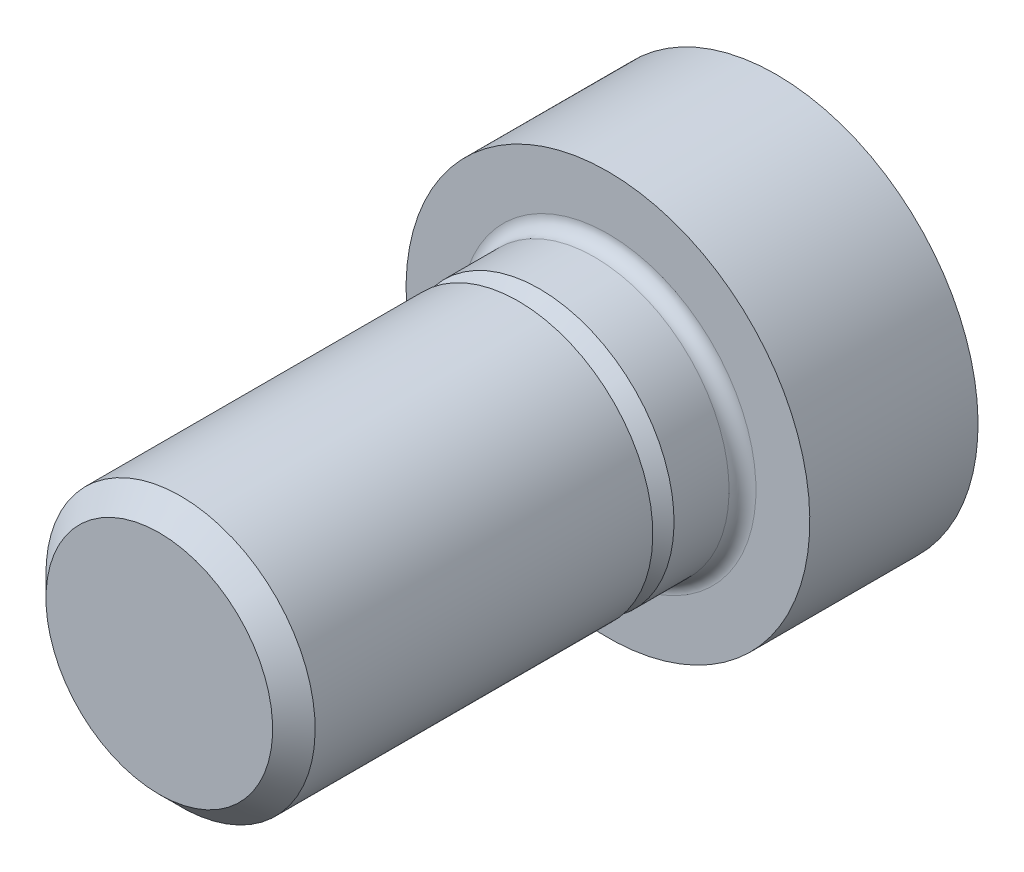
ISO-10303-21;
HEADER;
FILE_DESCRIPTION(('STEP AP214'),'2;1');
FILE_NAME('part.step','',(''),(''),'','','');
FILE_SCHEMA(('AUTOMOTIVE_DESIGN { 1 0 10303 214 1 1 1 1 }'));
ENDSEC;
DATA;
#1=APPLICATION_CONTEXT('core data for automotive mechanical design processes');
#2=APPLICATION_PROTOCOL_DEFINITION('international standard','automotive_design',2000,#1);
#3=PRODUCT_CONTEXT('',#1,'mechanical');
#4=PRODUCT('Part','Part','',(#3));
#5=PRODUCT_RELATED_PRODUCT_CATEGORY('part','',(#4));
#6=PRODUCT_DEFINITION_FORMATION('','',#4);
#7=PRODUCT_DEFINITION_CONTEXT('part definition',#1,'design');
#8=PRODUCT_DEFINITION('design','',#6,#7);
#9=PRODUCT_DEFINITION_SHAPE('','',#8);
#10=(LENGTH_UNIT() NAMED_UNIT(*) SI_UNIT(.MILLI.,.METRE.));
#11=(NAMED_UNIT(*) PLANE_ANGLE_UNIT() SI_UNIT($,.RADIAN.));
#12=(NAMED_UNIT(*) SI_UNIT($,.STERADIAN.) SOLID_ANGLE_UNIT());
#13=UNCERTAINTY_MEASURE_WITH_UNIT(LENGTH_MEASURE(1.E-05),#10,'distance_accuracy_value','');
#14=(GEOMETRIC_REPRESENTATION_CONTEXT(3) GLOBAL_UNCERTAINTY_ASSIGNED_CONTEXT((#13)) GLOBAL_UNIT_ASSIGNED_CONTEXT((#10,
#11,#12)) REPRESENTATION_CONTEXT('',''));
#15=CARTESIAN_POINT('',(0.,0.,0.));
#16=DIRECTION('',(0.,0.,1.));
#17=DIRECTION('',(1.,0.,0.));
#18=AXIS2_PLACEMENT_3D('',#15,#16,#17);
#19=CARTESIAN_POINT('',(0.,2.52640625,27.5));
#20=DIRECTION('',(0.,0.,1.));
#21=DIRECTION('',(0.,1.,0.));
#22=AXIS2_PLACEMENT_3D('',#19,#20,#21);
#23=PLANE('',#22);
#24=CARTESIAN_POINT('',(0.,0.,27.5));
#25=DIRECTION('',(0.,0.,1.));
#26=DIRECTION('',(0.,1.,0.));
#27=AXIS2_PLACEMENT_3D('',#24,#25,#26);
#28=CIRCLE('',#27,5.0528125);
#29=CARTESIAN_POINT('',(0.,5.0528125,27.5));
#30=VERTEX_POINT('',#29);
#31=EDGE_CURVE('E11',#30,#30,#28,.T.);
#32=ORIENTED_EDGE('',*,*,#31,.T.);
#33=EDGE_LOOP('',(#32));
#34=FACE_BOUND('',#33,.T.);
#35=ADVANCED_FACE('F16',(#34),#23,.T.);
#36=CARTESIAN_POINT('',(0.,0.,27.02640625));
#37=DIRECTION('',(0.,0.,-1.));
#38=DIRECTION('',(0.,1.,0.));
#39=AXIS2_PLACEMENT_3D('',#36,#37,#38);
#40=CONICAL_SURFACE('',#39,5.52640625,0.785398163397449);
#41=CARTESIAN_POINT('',(0.,0.,26.5528125));
#42=DIRECTION('',(0.,0.,1.));
#43=DIRECTION('',(0.,1.,0.));
#44=AXIS2_PLACEMENT_3D('',#41,#42,#43);
#45=CIRCLE('',#44,6.);
#46=CARTESIAN_POINT('',(0.,6.,26.5528125));
#47=VERTEX_POINT('',#46);
#48=EDGE_CURVE('E26',#47,#47,#45,.T.);
#49=ORIENTED_EDGE('',*,*,#48,.T.);
#50=EDGE_LOOP('',(#49));
#51=FACE_BOUND('',#50,.T.);
#52=ORIENTED_EDGE('',*,*,#31,.F.);
#53=EDGE_LOOP('',(#52));
#54=FACE_BOUND('',#53,.T.);
#55=ADVANCED_FACE('F331',(#51,#54),#40,.T.);
#56=CARTESIAN_POINT('',(0.,0.,19.02640625));
#57=DIRECTION('',(0.,0.,-1.));
#58=DIRECTION('',(0.,1.,0.));
#59=AXIS2_PLACEMENT_3D('',#56,#57,#58);
#60=CYLINDRICAL_SURFACE('',#59,6.);
#61=CARTESIAN_POINT('',(0.,0.,11.5));
#62=DIRECTION('',(0.,0.,1.));
#63=DIRECTION('',(0.,1.,0.));
#64=AXIS2_PLACEMENT_3D('',#61,#62,#63);
#65=CIRCLE('',#64,6.);
#66=CARTESIAN_POINT('',(0.,6.,11.5));
#67=VERTEX_POINT('',#66);
#68=EDGE_CURVE('E167',#67,#67,#65,.T.);
#69=ORIENTED_EDGE('',*,*,#68,.T.);
#70=EDGE_LOOP('',(#69));
#71=FACE_BOUND('',#70,.T.);
#72=ORIENTED_EDGE('',*,*,#48,.F.);
#73=EDGE_LOOP('',(#72));
#74=FACE_BOUND('',#73,.T.);
#75=ADVANCED_FACE('F336',(#71,#74),#60,.T.);
#76=CARTESIAN_POINT('',(0.,5.52640625,11.5));
#77=DIRECTION('',(0.,0.,-1.));
#78=DIRECTION('',(0.,-1.,0.));
#79=AXIS2_PLACEMENT_3D('',#76,#77,#78);
#80=PLANE('',#79);
#81=CARTESIAN_POINT('',(0.,0.,11.5));
#82=DIRECTION('',(0.,0.,1.));
#83=DIRECTION('',(0.,1.,0.));
#84=AXIS2_PLACEMENT_3D('',#81,#82,#83);
#85=CIRCLE('',#84,5.0528125);
#86=CARTESIAN_POINT('',(0.,5.0528125,11.5));
#87=VERTEX_POINT('',#86);
#88=EDGE_CURVE('E165',#87,#87,#85,.T.);
#89=ORIENTED_EDGE('',*,*,#88,.T.);
#90=EDGE_LOOP('',(#89));
#91=FACE_BOUND('',#90,.T.);
#92=ORIENTED_EDGE('',*,*,#68,.F.);
#93=EDGE_LOOP('',(#92));
#94=FACE_BOUND('',#93,.T.);
#95=ADVANCED_FACE('F368',(#91,#94),#80,.T.);
#96=CARTESIAN_POINT('',(0.,0.,11.02640625));
#97=DIRECTION('',(0.,0.,-1.));
#98=DIRECTION('',(0.,1.,0.));
#99=AXIS2_PLACEMENT_3D('',#96,#97,#98);
#100=CONICAL_SURFACE('',#99,5.52640625,0.785398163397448);
#101=CARTESIAN_POINT('',(0.,0.,10.5528125));
#102=DIRECTION('',(0.,0.,1.));
#103=DIRECTION('',(0.,1.,0.));
#104=AXIS2_PLACEMENT_3D('',#101,#102,#103);
#105=CIRCLE('',#104,6.);
#106=CARTESIAN_POINT('',(0.,6.,10.5528125));
#107=VERTEX_POINT('',#106);
#108=EDGE_CURVE('E163',#107,#107,#105,.T.);
#109=ORIENTED_EDGE('',*,*,#108,.T.);
#110=EDGE_LOOP('',(#109));
#111=FACE_BOUND('',#110,.T.);
#112=ORIENTED_EDGE('',*,*,#88,.F.);
#113=EDGE_LOOP('',(#112));
#114=FACE_BOUND('',#113,.T.);
#115=ADVANCED_FACE('F345',(#111,#114),#100,.T.);
#116=CARTESIAN_POINT('',(0.,0.,9.32640625));
#117=DIRECTION('',(0.,0.,-1.));
#118=DIRECTION('',(0.,1.,0.));
#119=AXIS2_PLACEMENT_3D('',#116,#117,#118);
#120=CYLINDRICAL_SURFACE('',#119,6.);
#121=CARTESIAN_POINT('',(0.,0.,8.1));
#122=DIRECTION('',(0.,0.,1.));
#123=DIRECTION('',(0.,1.,0.));
#124=AXIS2_PLACEMENT_3D('',#121,#122,#123);
#125=CIRCLE('',#124,6.);
#126=CARTESIAN_POINT('',(0.,6.,8.1));
#127=VERTEX_POINT('',#126);
#128=EDGE_CURVE('E158',#127,#127,#125,.T.);
#129=ORIENTED_EDGE('',*,*,#128,.T.);
#130=EDGE_LOOP('',(#129));
#131=FACE_BOUND('',#130,.T.);
#132=ORIENTED_EDGE('',*,*,#108,.F.);
#133=EDGE_LOOP('',(#132));
#134=FACE_BOUND('',#133,.T.);
#135=ADVANCED_FACE('F341',(#131,#134),#120,.T.);
#136=CARTESIAN_POINT('',(0.,0.,8.1));
#137=DIRECTION('',(0.,0.,1.));
#138=DIRECTION('',(1.,0.,0.));
#139=AXIS2_PLACEMENT_3D('',#136,#137,#138);
#140=TOROIDAL_SURFACE('',#139,6.6,0.6);
#141=CARTESIAN_POINT('',(0.,0.,7.5));
#142=DIRECTION('',(0.,0.,1.));
#143=DIRECTION('',(0.,1.,0.));
#144=AXIS2_PLACEMENT_3D('',#141,#142,#143);
#145=CIRCLE('',#144,6.6);
#146=CARTESIAN_POINT('',(0.,6.6,7.5));
#147=VERTEX_POINT('',#146);
#148=EDGE_CURVE('E164',#147,#147,#145,.T.);
#149=ORIENTED_EDGE('',*,*,#148,.T.);
#150=EDGE_LOOP('',(#149));
#151=FACE_BOUND('',#150,.T.);
#152=ORIENTED_EDGE('',*,*,#128,.F.);
#153=EDGE_LOOP('',(#152));
#154=FACE_BOUND('',#153,.T.);
#155=ADVANCED_FACE('F344',(#151,#154),#140,.F.);
#156=CARTESIAN_POINT('',(0.,7.8,7.5));
#157=DIRECTION('',(0.,0.,1.));
#158=DIRECTION('',(0.,1.,0.));
#159=AXIS2_PLACEMENT_3D('',#156,#157,#158);
#160=PLANE('',#159);
#161=CARTESIAN_POINT('',(0.,0.,7.5));
#162=DIRECTION('',(0.,0.,1.));
#163=DIRECTION('',(0.,1.,0.));
#164=AXIS2_PLACEMENT_3D('',#161,#162,#163);
#165=CIRCLE('',#164,9.);
#166=CARTESIAN_POINT('',(0.,9.,7.5));
#167=VERTEX_POINT('',#166);
#168=EDGE_CURVE('E204',#167,#167,#165,.T.);
#169=ORIENTED_EDGE('',*,*,#168,.T.);
#170=EDGE_LOOP('',(#169));
#171=FACE_BOUND('',#170,.T.);
#172=ORIENTED_EDGE('',*,*,#148,.F.);
#173=EDGE_LOOP('',(#172));
#174=FACE_BOUND('',#173,.T.);
#175=ADVANCED_FACE('F461',(#171,#174),#160,.T.);
#176=CARTESIAN_POINT('',(0.,0.,3.75));
#177=DIRECTION('',(0.,0.,-1.));
#178=DIRECTION('',(0.,1.,0.));
#179=AXIS2_PLACEMENT_3D('',#176,#177,#178);
#180=CYLINDRICAL_SURFACE('',#179,9.);
#181=CARTESIAN_POINT('',(0.,0.,0.));
#182=DIRECTION('',(0.,0.,1.));
#183=DIRECTION('',(0.,1.,0.));
#184=AXIS2_PLACEMENT_3D('',#181,#182,#183);
#185=CIRCLE('',#184,9.);
#186=CARTESIAN_POINT('',(0.,9.,0.));
#187=VERTEX_POINT('',#186);
#188=EDGE_CURVE('E202',#187,#187,#185,.T.);
#189=ORIENTED_EDGE('',*,*,#188,.T.);
#190=EDGE_LOOP('',(#189));
#191=FACE_BOUND('',#190,.T.);
#192=ORIENTED_EDGE('',*,*,#168,.F.);
#193=EDGE_LOOP('',(#192));
#194=FACE_BOUND('',#193,.T.);
#195=ADVANCED_FACE('F452',(#191,#194),#180,.T.);
#196=CARTESIAN_POINT('',(0.,4.5,0.));
#197=DIRECTION('',(0.,0.,-1.));
#198=DIRECTION('',(0.,-1.,0.));
#199=AXIS2_PLACEMENT_3D('',#196,#197,#198);
#200=PLANE('',#199);
#201=ORIENTED_EDGE('',*,*,#188,.F.);
#202=EDGE_LOOP('',(#201));
#203=FACE_BOUND('',#202,.T.);
#204=DIRECTION('',(0.866025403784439,-0.5,0.));
#205=VECTOR('',#204,1.);
#206=CARTESIAN_POINT('',(-3.47427857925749,-3.76762701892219,0.));
#207=LINE('',#206,#205);
#208=CARTESIAN_POINT('',(-5.,-2.88675134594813,0.));
#209=VERTEX_POINT('',#208);
#210=CARTESIAN_POINT('',(0.,-5.77350269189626,0.));
#211=VERTEX_POINT('',#210);
#212=EDGE_CURVE('E117',#209,#211,#207,.T.);
#213=ORIENTED_EDGE('',*,*,#212,.T.);
#214=DIRECTION('',(0.866025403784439,0.5,0.));
#215=VECTOR('',#214,1.);
#216=CARTESIAN_POINT('',(3.47427857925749,-3.76762701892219,0.));
#217=LINE('',#216,#215);
#218=CARTESIAN_POINT('',(5.,-2.88675134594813,0.));
#219=VERTEX_POINT('',#218);
#220=EDGE_CURVE('E256',#211,#219,#217,.T.);
#221=ORIENTED_EDGE('',*,*,#220,.T.);
#222=DIRECTION('',(0.,1.,0.));
#223=VECTOR('',#222,1.);
#224=CARTESIAN_POINT('',(5.,2.25,0.));
#225=LINE('',#224,#223);
#226=CARTESIAN_POINT('',(5.,2.88675134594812,0.));
#227=VERTEX_POINT('',#226);
#228=EDGE_CURVE('E245',#219,#227,#225,.T.);
#229=ORIENTED_EDGE('',*,*,#228,.T.);
#230=DIRECTION('',(-0.866025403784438,0.5,0.));
#231=VECTOR('',#230,1.);
#232=CARTESIAN_POINT('',(1.5257214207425,4.89262701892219,0.));
#233=LINE('',#232,#231);
#234=CARTESIAN_POINT('',(0.,5.77350269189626,0.));
#235=VERTEX_POINT('',#234);
#236=EDGE_CURVE('E181',#227,#235,#233,.T.);
#237=ORIENTED_EDGE('',*,*,#236,.T.);
#238=DIRECTION('',(-0.866025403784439,-0.5,0.));
#239=VECTOR('',#238,1.);
#240=CARTESIAN_POINT('',(-1.5257214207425,4.89262701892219,0.));
#241=LINE('',#240,#239);
#242=CARTESIAN_POINT('',(-5.,2.88675134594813,0.));
#243=VERTEX_POINT('',#242);
#244=EDGE_CURVE('E141',#235,#243,#241,.T.);
#245=ORIENTED_EDGE('',*,*,#244,.T.);
#246=DIRECTION('',(0.,-1.,0.));
#247=VECTOR('',#246,1.);
#248=CARTESIAN_POINT('',(-5.,2.25,0.));
#249=LINE('',#248,#247);
#250=EDGE_CURVE('E132',#243,#209,#249,.T.);
#251=ORIENTED_EDGE('',*,*,#250,.T.);
#252=EDGE_LOOP('',(#213,#221,#229,#237,#245,#251));
#253=FACE_BOUND('',#252,.T.);
#254=ADVANCED_FACE('F18',(#203,#253),#200,.T.);
#255=CARTESIAN_POINT('',(0.,0.,9.86602540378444));
#256=DIRECTION('',(0.,0.,-1.));
#257=DIRECTION('',(0.,1.,0.));
#258=AXIS2_PLACEMENT_3D('',#255,#256,#257);
#259=CONICAL_SURFACE('',#258,1.5,1.0471975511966);
#260=CARTESIAN_POINT('',(0.,0.,9.));
#261=DIRECTION('',(0.,0.,1.));
#262=DIRECTION('',(0.,1.,0.));
#263=AXIS2_PLACEMENT_3D('',#260,#261,#262);
#264=CIRCLE('',#263,3.);
#265=CARTESIAN_POINT('',(0.,3.,9.));
#266=VERTEX_POINT('',#265);
#267=EDGE_CURVE('E205',#266,#266,#264,.T.);
#268=ORIENTED_EDGE('',*,*,#267,.F.);
#269=EDGE_LOOP('',(#268));
#270=FACE_BOUND('',#269,.T.);
#271=CARTESIAN_POINT('',(0.,0.,10.7320508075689));
#272=VERTEX_POINT('',#271);
#273=VERTEX_LOOP('',#272);
#274=FACE_BOUND('',#273,.T.);
#275=ADVANCED_FACE('F347',(#270,#274),#259,.F.);
#276=CARTESIAN_POINT('',(0.,0.,4.55));
#277=DIRECTION('',(0.,0.,-1.));
#278=DIRECTION('',(0.,1.,0.));
#279=AXIS2_PLACEMENT_3D('',#276,#277,#278);
#280=CYLINDRICAL_SURFACE('',#279,3.);
#281=ORIENTED_EDGE('',*,*,#267,.T.);
#282=EDGE_LOOP('',(#281));
#283=FACE_BOUND('',#282,.T.);
#284=CARTESIAN_POINT('',(0.,0.,4.));
#285=DIRECTION('',(0.,0.,-1.));
#286=DIRECTION('',(0.,1.,0.));
#287=AXIS2_PLACEMENT_3D('',#284,#285,#286);
#288=CIRCLE('',#287,3.);
#289=CARTESIAN_POINT('',(0.,-3.,4.));
#290=VERTEX_POINT('',#289);
#291=EDGE_CURVE('E241',#290,#290,#288,.T.);
#292=ORIENTED_EDGE('',*,*,#291,.T.);
#293=EDGE_LOOP('',(#292));
#294=FACE_BOUND('',#293,.T.);
#295=ADVANCED_FACE('F350',(#283,#294),#280,.F.);
#296=CARTESIAN_POINT('',(2.5,-4.3301270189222,-2.));
#297=DIRECTION('',(0.5,-0.866025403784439,0.));
#298=DIRECTION('',(0.866025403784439,0.5,0.));
#299=AXIS2_PLACEMENT_3D('',#296,#297,#298);
#300=PLANE('',#299);
#301=ORIENTED_EDGE('',*,*,#220,.F.);
#302=DIRECTION('',(0.,0.,1.));
#303=VECTOR('',#302,1.);
#304=CARTESIAN_POINT('',(0.,-5.77350269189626,-2.));
#305=LINE('',#304,#303);
#306=CARTESIAN_POINT('',(0.,-5.77350269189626,3.5534180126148));
#307=VERTEX_POINT('',#306);
#308=EDGE_CURVE('E20',#211,#307,#305,.T.);
#309=ORIENTED_EDGE('',*,*,#308,.T.);
#310=CARTESIAN_POINT('',(-0.00259240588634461,-5.77499941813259,3.55255354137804));
#311=CARTESIAN_POINT('',(1.33870422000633,-5.00060145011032,4.));
#312=CARTESIAN_POINT('',(2.5,-4.3301270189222,4.));
#313=CARTESIAN_POINT('',(3.66129577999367,-3.65965258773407,4.));
#314=CARTESIAN_POINT('',(5.00259240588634,-2.8852546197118,3.55255354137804));
#315=(BOUNDED_CURVE() B_SPLINE_CURVE(2,(#310,#311,#312,#313,#314),.UNSPECIFIED.,.F.,
.F.) B_SPLINE_CURVE_WITH_KNOTS((3,2,3),(0.,2.9316581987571,5.8633163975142),
.UNSPECIFIED.) CURVE() GEOMETRIC_REPRESENTATION_ITEM() RATIONAL_B_SPLINE_CURVE((1.,
1.03802697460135,1.,1.03802697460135,1.)) REPRESENTATION_ITEM(''));
#316=CARTESIAN_POINT('',(2.5,-4.3301270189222,4.));
#317=VERTEX_POINT('',#316);
#318=EDGE_CURVE('E151',#307,#317,#315,.T.);
#319=ORIENTED_EDGE('',*,*,#318,.T.);
#320=CARTESIAN_POINT('',(-0.00259240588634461,-5.77499941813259,3.55255354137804));
#321=CARTESIAN_POINT('',(1.33870422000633,-5.00060145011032,4.));
#322=CARTESIAN_POINT('',(2.5,-4.3301270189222,4.));
#323=CARTESIAN_POINT('',(3.66129577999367,-3.65965258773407,4.));
#324=CARTESIAN_POINT('',(5.00259240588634,-2.8852546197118,3.55255354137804));
#325=(BOUNDED_CURVE() B_SPLINE_CURVE(2,(#320,#321,#322,#323,#324),.UNSPECIFIED.,.F.,
.F.) B_SPLINE_CURVE_WITH_KNOTS((3,2,3),(0.,2.9316581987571,5.8633163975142),
.UNSPECIFIED.) CURVE() GEOMETRIC_REPRESENTATION_ITEM() RATIONAL_B_SPLINE_CURVE((1.,
1.03802697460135,1.,1.03802697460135,1.)) REPRESENTATION_ITEM(''));
#326=CARTESIAN_POINT('',(5.,-2.88675134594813,3.5534180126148));
#327=VERTEX_POINT('',#326);
#328=EDGE_CURVE('E156',#317,#327,#325,.T.);
#329=ORIENTED_EDGE('',*,*,#328,.T.);
#330=DIRECTION('',(0.,0.,1.));
#331=VECTOR('',#330,1.);
#332=CARTESIAN_POINT('',(5.,-2.88675134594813,-2.));
#333=LINE('',#332,#331);
#334=EDGE_CURVE('E126',#219,#327,#333,.T.);
#335=ORIENTED_EDGE('',*,*,#334,.F.);
#336=EDGE_LOOP('',(#301,#309,#319,#329,#335));
#337=FACE_BOUND('',#336,.T.);
#338=ADVANCED_FACE('F305',(#337),#300,.F.);
#339=CARTESIAN_POINT('',(-2.5,-4.3301270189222,-2.));
#340=DIRECTION('',(-0.5,-0.866025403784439,0.));
#341=DIRECTION('',(0.866025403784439,-0.5,0.));
#342=AXIS2_PLACEMENT_3D('',#339,#340,#341);
#343=PLANE('',#342);
#344=ORIENTED_EDGE('',*,*,#212,.F.);
#345=DIRECTION('',(0.,0.,1.));
#346=VECTOR('',#345,1.);
#347=CARTESIAN_POINT('',(-5.,-2.88675134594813,-2.));
#348=LINE('',#347,#346);
#349=CARTESIAN_POINT('',(-5.,-2.88675134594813,3.5534180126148));
#350=VERTEX_POINT('',#349);
#351=EDGE_CURVE('E121',#209,#350,#348,.T.);
#352=ORIENTED_EDGE('',*,*,#351,.T.);
#353=CARTESIAN_POINT('',(-5.00259240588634,-2.8852546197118,3.55255354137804));
#354=CARTESIAN_POINT('',(-3.66129577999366,-3.65965258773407,4.));
#355=CARTESIAN_POINT('',(-2.5,-4.3301270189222,4.));
#356=CARTESIAN_POINT('',(-1.33870422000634,-5.00060145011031,4.));
#357=CARTESIAN_POINT('',(0.00259240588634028,-5.77499941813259,3.55255354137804));
#358=(BOUNDED_CURVE() B_SPLINE_CURVE(2,(#353,#354,#355,#356,#357),.UNSPECIFIED.,.F.,
.F.) B_SPLINE_CURVE_WITH_KNOTS((3,2,3),(0.,2.93165819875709,5.86331639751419),
.UNSPECIFIED.) CURVE() GEOMETRIC_REPRESENTATION_ITEM() RATIONAL_B_SPLINE_CURVE((1.,
1.03802697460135,1.,1.03802697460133,1.)) REPRESENTATION_ITEM(''));
#359=CARTESIAN_POINT('',(-2.5,-4.3301270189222,4.));
#360=VERTEX_POINT('',#359);
#361=EDGE_CURVE('E209',#350,#360,#358,.T.);
#362=ORIENTED_EDGE('',*,*,#361,.T.);
#363=CARTESIAN_POINT('',(-5.00259240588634,-2.8852546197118,3.55255354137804));
#364=CARTESIAN_POINT('',(-3.66129577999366,-3.65965258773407,4.));
#365=CARTESIAN_POINT('',(-2.5,-4.3301270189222,4.));
#366=CARTESIAN_POINT('',(-1.33870422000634,-5.00060145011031,4.));
#367=CARTESIAN_POINT('',(0.00259240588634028,-5.77499941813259,3.55255354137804));
#368=(BOUNDED_CURVE() B_SPLINE_CURVE(2,(#363,#364,#365,#366,#367),.UNSPECIFIED.,.F.,
.F.) B_SPLINE_CURVE_WITH_KNOTS((3,2,3),(0.,2.93165819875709,5.86331639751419),
.UNSPECIFIED.) CURVE() GEOMETRIC_REPRESENTATION_ITEM() RATIONAL_B_SPLINE_CURVE((1.,
1.03802697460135,1.,1.03802697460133,1.)) REPRESENTATION_ITEM(''));
#369=EDGE_CURVE('E206',#360,#307,#368,.T.);
#370=ORIENTED_EDGE('',*,*,#369,.T.);
#371=ORIENTED_EDGE('',*,*,#308,.F.);
#372=EDGE_LOOP('',(#344,#352,#362,#370,#371));
#373=FACE_BOUND('',#372,.T.);
#374=ADVANCED_FACE('F119',(#373),#343,.F.);
#375=CARTESIAN_POINT('',(5.,0.,-2.));
#376=DIRECTION('',(1.,0.,0.));
#377=DIRECTION('',(0.,1.,0.));
#378=AXIS2_PLACEMENT_3D('',#375,#376,#377);
#379=PLANE('',#378);
#380=ORIENTED_EDGE('',*,*,#228,.F.);
#381=ORIENTED_EDGE('',*,*,#334,.T.);
#382=CARTESIAN_POINT('',(5.,-2.88974479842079,3.55255354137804));
#383=CARTESIAN_POINT('',(5.,-1.34094886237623,4.));
#384=CARTESIAN_POINT('',(5.,0.,4.));
#385=CARTESIAN_POINT('',(5.,1.34094886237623,4.));
#386=CARTESIAN_POINT('',(5.,2.88974479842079,3.55255354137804));
#387=(BOUNDED_CURVE() B_SPLINE_CURVE(2,(#382,#383,#384,#385,#386),.UNSPECIFIED.,.F.,
.F.) B_SPLINE_CURVE_WITH_KNOTS((3,2,3),(0.,2.9316581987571,5.8633163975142),
.UNSPECIFIED.) CURVE() GEOMETRIC_REPRESENTATION_ITEM() RATIONAL_B_SPLINE_CURVE((1.,
1.03802697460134,1.,1.03802697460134,1.)) REPRESENTATION_ITEM(''));
#388=CARTESIAN_POINT('',(5.,0.,4.));
#389=VERTEX_POINT('',#388);
#390=EDGE_CURVE('E201',#327,#389,#387,.T.);
#391=ORIENTED_EDGE('',*,*,#390,.T.);
#392=CARTESIAN_POINT('',(5.,-2.88974479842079,3.55255354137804));
#393=CARTESIAN_POINT('',(5.,-1.34094886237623,4.));
#394=CARTESIAN_POINT('',(5.,0.,4.));
#395=CARTESIAN_POINT('',(5.,1.34094886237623,4.));
#396=CARTESIAN_POINT('',(5.,2.88974479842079,3.55255354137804));
#397=(BOUNDED_CURVE() B_SPLINE_CURVE(2,(#392,#393,#394,#395,#396),.UNSPECIFIED.,.F.,
.F.) B_SPLINE_CURVE_WITH_KNOTS((3,2,3),(0.,2.9316581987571,5.8633163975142),
.UNSPECIFIED.) CURVE() GEOMETRIC_REPRESENTATION_ITEM() RATIONAL_B_SPLINE_CURVE((1.,
1.03802697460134,1.,1.03802697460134,1.)) REPRESENTATION_ITEM(''));
#398=CARTESIAN_POINT('',(5.,2.88675134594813,3.5534180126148));
#399=VERTEX_POINT('',#398);
#400=EDGE_CURVE('E137',#389,#399,#397,.T.);
#401=ORIENTED_EDGE('',*,*,#400,.T.);
#402=DIRECTION('',(0.,0.,1.));
#403=VECTOR('',#402,1.);
#404=CARTESIAN_POINT('',(5.,2.88675134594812,-2.));
#405=LINE('',#404,#403);
#406=EDGE_CURVE('E179',#227,#399,#405,.T.);
#407=ORIENTED_EDGE('',*,*,#406,.F.);
#408=EDGE_LOOP('',(#380,#381,#391,#401,#407));
#409=FACE_BOUND('',#408,.T.);
#410=ADVANCED_FACE('F309',(#409),#379,.F.);
#411=CARTESIAN_POINT('',(0.,-2.5,4.));
#412=DIRECTION('',(0.,0.,1.));
#413=DIRECTION('',(0.,-1.,0.));
#414=AXIS2_PLACEMENT_3D('',#411,#412,#413);
#415=PLANE('',#414);
#416=CARTESIAN_POINT('',(0.,0.,4.));
#417=DIRECTION('',(0.,0.,1.));
#418=DIRECTION('',(0.,-1.,0.));
#419=AXIS2_PLACEMENT_3D('',#416,#417,#418);
#420=CIRCLE('',#419,5.);
#421=EDGE_CURVE('E157',#360,#317,#420,.T.);
#422=ORIENTED_EDGE('',*,*,#421,.F.);
#423=CARTESIAN_POINT('',(0.,0.,4.));
#424=DIRECTION('',(0.,0.,1.));
#425=DIRECTION('',(0.,-1.,0.));
#426=AXIS2_PLACEMENT_3D('',#423,#424,#425);
#427=CIRCLE('',#426,5.);
#428=CARTESIAN_POINT('',(-5.,0.,4.));
#429=VERTEX_POINT('',#428);
#430=EDGE_CURVE('E223',#429,#360,#427,.T.);
#431=ORIENTED_EDGE('',*,*,#430,.F.);
#432=CARTESIAN_POINT('',(0.,0.,4.));
#433=DIRECTION('',(0.,0.,1.));
#434=DIRECTION('',(0.,-1.,0.));
#435=AXIS2_PLACEMENT_3D('',#432,#433,#434);
#436=CIRCLE('',#435,5.);
#437=CARTESIAN_POINT('',(-2.5,4.3301270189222,4.));
#438=VERTEX_POINT('',#437);
#439=EDGE_CURVE('E226',#438,#429,#436,.T.);
#440=ORIENTED_EDGE('',*,*,#439,.F.);
#441=CARTESIAN_POINT('',(0.,0.,4.));
#442=DIRECTION('',(0.,0.,1.));
#443=DIRECTION('',(0.,-1.,0.));
#444=AXIS2_PLACEMENT_3D('',#441,#442,#443);
#445=CIRCLE('',#444,5.);
#446=CARTESIAN_POINT('',(2.5,4.3301270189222,4.));
#447=VERTEX_POINT('',#446);
#448=EDGE_CURVE('E237',#447,#438,#445,.T.);
#449=ORIENTED_EDGE('',*,*,#448,.F.);
#450=CARTESIAN_POINT('',(0.,0.,4.));
#451=DIRECTION('',(0.,0.,1.));
#452=DIRECTION('',(0.,-1.,0.));
#453=AXIS2_PLACEMENT_3D('',#450,#451,#452);
#454=CIRCLE('',#453,5.);
#455=EDGE_CURVE('E231',#389,#447,#454,.T.);
#456=ORIENTED_EDGE('',*,*,#455,.F.);
#457=CARTESIAN_POINT('',(0.,0.,4.));
#458=DIRECTION('',(0.,0.,1.));
#459=DIRECTION('',(0.,-1.,0.));
#460=AXIS2_PLACEMENT_3D('',#457,#458,#459);
#461=CIRCLE('',#460,5.);
#462=EDGE_CURVE('E195',#317,#389,#461,.T.);
#463=ORIENTED_EDGE('',*,*,#462,.F.);
#464=EDGE_LOOP('',(#422,#431,#440,#449,#456,#463));
#465=FACE_BOUND('',#464,.T.);
#466=ORIENTED_EDGE('',*,*,#291,.F.);
#467=EDGE_LOOP('',(#466));
#468=FACE_BOUND('',#467,.T.);
#469=ADVANCED_FACE('F298',(#465,#468),#415,.F.);
#470=CARTESIAN_POINT('',(0.,0.,3.77627677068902));
#471=DIRECTION('',(0.,0.,-1.));
#472=DIRECTION('',(0.,-1.,0.));
#473=AXIS2_PLACEMENT_3D('',#470,#471,#472);
#474=CONICAL_SURFACE('',#473,5.3875,1.0471975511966);
#475=ORIENTED_EDGE('',*,*,#328,.F.);
#476=ORIENTED_EDGE('',*,*,#462,.T.);
#477=ORIENTED_EDGE('',*,*,#390,.F.);
#478=EDGE_LOOP('',(#475,#476,#477));
#479=FACE_BOUND('',#478,.T.);
#480=ADVANCED_FACE('F318',(#479),#474,.F.);
#481=CARTESIAN_POINT('',(0.,0.,3.77627677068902));
#482=DIRECTION('',(0.,0.,-1.));
#483=DIRECTION('',(0.,-1.,0.));
#484=AXIS2_PLACEMENT_3D('',#481,#482,#483);
#485=CONICAL_SURFACE('',#484,5.3875,1.0471975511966);
#486=ORIENTED_EDGE('',*,*,#369,.F.);
#487=ORIENTED_EDGE('',*,*,#421,.T.);
#488=ORIENTED_EDGE('',*,*,#318,.F.);
#489=EDGE_LOOP('',(#486,#487,#488));
#490=FACE_BOUND('',#489,.T.);
#491=ADVANCED_FACE('F303',(#490),#485,.F.);
#492=CARTESIAN_POINT('',(0.,0.,3.77627677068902));
#493=DIRECTION('',(0.,0.,-1.));
#494=DIRECTION('',(0.,-1.,0.));
#495=AXIS2_PLACEMENT_3D('',#492,#493,#494);
#496=CONICAL_SURFACE('',#495,5.3875,1.0471975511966);
#497=CARTESIAN_POINT('',(-5.,2.88974479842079,3.55255354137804));
#498=CARTESIAN_POINT('',(-4.99999999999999,1.34094886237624,3.99999999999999));
#499=CARTESIAN_POINT('',(-5.,0.,4.));
#500=CARTESIAN_POINT('',(-5.,-1.34094886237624,4.));
#501=CARTESIAN_POINT('',(-5.,-2.88974479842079,3.55255354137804));
#502=(BOUNDED_CURVE() B_SPLINE_CURVE(2,(#497,#498,#499,#500,#501),.UNSPECIFIED.,.F.,
.F.) B_SPLINE_CURVE_WITH_KNOTS((3,2,3),(0.,2.9316581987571,5.8633163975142),
.UNSPECIFIED.) CURVE() GEOMETRIC_REPRESENTATION_ITEM() RATIONAL_B_SPLINE_CURVE((1.,
1.03802697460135,1.,1.03802697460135,1.)) REPRESENTATION_ITEM(''));
#503=EDGE_CURVE('E136',#429,#350,#502,.T.);
#504=ORIENTED_EDGE('',*,*,#503,.F.);
#505=ORIENTED_EDGE('',*,*,#430,.T.);
#506=ORIENTED_EDGE('',*,*,#361,.F.);
#507=EDGE_LOOP('',(#504,#505,#506));
#508=FACE_BOUND('',#507,.T.);
#509=ADVANCED_FACE('F297',(#508),#496,.F.);
#510=CARTESIAN_POINT('',(0.,0.,3.77627677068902));
#511=DIRECTION('',(0.,0.,-1.));
#512=DIRECTION('',(0.,-1.,0.));
#513=AXIS2_PLACEMENT_3D('',#510,#511,#512);
#514=CONICAL_SURFACE('',#513,5.3875,1.0471975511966);
#515=CARTESIAN_POINT('',(-5.,2.88974479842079,3.55255354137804));
#516=CARTESIAN_POINT('',(-4.99999999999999,1.34094886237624,3.99999999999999));
#517=CARTESIAN_POINT('',(-5.,0.,4.));
#518=CARTESIAN_POINT('',(-5.,-1.34094886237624,4.));
#519=CARTESIAN_POINT('',(-5.,-2.88974479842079,3.55255354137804));
#520=(BOUNDED_CURVE() B_SPLINE_CURVE(2,(#515,#516,#517,#518,#519),.UNSPECIFIED.,.F.,
.F.) B_SPLINE_CURVE_WITH_KNOTS((3,2,3),(0.,2.9316581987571,5.8633163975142),
.UNSPECIFIED.) CURVE() GEOMETRIC_REPRESENTATION_ITEM() RATIONAL_B_SPLINE_CURVE((1.,
1.03802697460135,1.,1.03802697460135,1.)) REPRESENTATION_ITEM(''));
#521=CARTESIAN_POINT('',(-5.,2.88675134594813,3.5534180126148));
#522=VERTEX_POINT('',#521);
#523=EDGE_CURVE('E142',#522,#429,#520,.T.);
#524=ORIENTED_EDGE('',*,*,#523,.F.);
#525=CARTESIAN_POINT('',(0.00259240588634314,5.77499941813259,3.55255354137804));
#526=CARTESIAN_POINT('',(-1.33870422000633,5.00060145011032,4.));
#527=CARTESIAN_POINT('',(-2.5,4.3301270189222,4.));
#528=CARTESIAN_POINT('',(-3.66129577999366,3.65965258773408,4.));
#529=CARTESIAN_POINT('',(-5.00259240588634,2.88525461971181,3.55255354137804));
#530=(BOUNDED_CURVE() B_SPLINE_CURVE(2,(#525,#526,#527,#528,#529),.UNSPECIFIED.,.F.,
.F.) B_SPLINE_CURVE_WITH_KNOTS((3,2,3),(0.,2.93165819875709,5.86331639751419),
.UNSPECIFIED.) CURVE() GEOMETRIC_REPRESENTATION_ITEM() RATIONAL_B_SPLINE_CURVE((1.,
1.03802697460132,1.,1.03802697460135,1.)) REPRESENTATION_ITEM(''));
#531=EDGE_CURVE('E146',#438,#522,#530,.T.);
#532=ORIENTED_EDGE('',*,*,#531,.F.);
#533=ORIENTED_EDGE('',*,*,#439,.T.);
#534=EDGE_LOOP('',(#524,#532,#533));
#535=FACE_BOUND('',#534,.T.);
#536=ADVANCED_FACE('F271',(#535),#514,.F.);
#537=CARTESIAN_POINT('',(0.,0.,3.77627677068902));
#538=DIRECTION('',(0.,0.,-1.));
#539=DIRECTION('',(0.,-1.,0.));
#540=AXIS2_PLACEMENT_3D('',#537,#538,#539);
#541=CONICAL_SURFACE('',#540,5.3875,1.0471975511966);
#542=CARTESIAN_POINT('',(0.00259240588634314,5.77499941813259,3.55255354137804));
#543=CARTESIAN_POINT('',(-1.33870422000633,5.00060145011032,4.));
#544=CARTESIAN_POINT('',(-2.5,4.3301270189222,4.));
#545=CARTESIAN_POINT('',(-3.66129577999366,3.65965258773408,4.));
#546=CARTESIAN_POINT('',(-5.00259240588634,2.88525461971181,3.55255354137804));
#547=(BOUNDED_CURVE() B_SPLINE_CURVE(2,(#542,#543,#544,#545,#546),.UNSPECIFIED.,.F.,
.F.) B_SPLINE_CURVE_WITH_KNOTS((3,2,3),(0.,2.93165819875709,5.86331639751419),
.UNSPECIFIED.) CURVE() GEOMETRIC_REPRESENTATION_ITEM() RATIONAL_B_SPLINE_CURVE((1.,
1.03802697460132,1.,1.03802697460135,1.)) REPRESENTATION_ITEM(''));
#548=CARTESIAN_POINT('',(0.,5.77350269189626,3.5534180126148));
#549=VERTEX_POINT('',#548);
#550=EDGE_CURVE('E178',#549,#438,#547,.T.);
#551=ORIENTED_EDGE('',*,*,#550,.F.);
#552=CARTESIAN_POINT('',(5.00259240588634,2.88525461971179,3.55255354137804));
#553=CARTESIAN_POINT('',(3.66129577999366,3.65965258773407,4.));
#554=CARTESIAN_POINT('',(2.5,4.33012701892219,4.));
#555=CARTESIAN_POINT('',(1.33870422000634,5.00060145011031,4.));
#556=CARTESIAN_POINT('',(-0.00259240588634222,5.77499941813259,3.55255354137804));
#557=(BOUNDED_CURVE() B_SPLINE_CURVE(2,(#552,#553,#554,#555,#556),.UNSPECIFIED.,.F.,
.F.) B_SPLINE_CURVE_WITH_KNOTS((3,2,3),(0.,2.9316581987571,5.8633163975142),
.UNSPECIFIED.) CURVE() GEOMETRIC_REPRESENTATION_ITEM() RATIONAL_B_SPLINE_CURVE((1.,
1.03802697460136,1.,1.03802697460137,1.)) REPRESENTATION_ITEM(''));
#558=EDGE_CURVE('E168',#447,#549,#557,.T.);
#559=ORIENTED_EDGE('',*,*,#558,.F.);
#560=ORIENTED_EDGE('',*,*,#448,.T.);
#561=EDGE_LOOP('',(#551,#559,#560));
#562=FACE_BOUND('',#561,.T.);
#563=ADVANCED_FACE('F265',(#562),#541,.F.);
#564=CARTESIAN_POINT('',(0.,0.,3.77627677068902));
#565=DIRECTION('',(0.,0.,-1.));
#566=DIRECTION('',(0.,-1.,0.));
#567=AXIS2_PLACEMENT_3D('',#564,#565,#566);
#568=CONICAL_SURFACE('',#567,5.3875,1.0471975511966);
#569=CARTESIAN_POINT('',(5.00259240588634,2.88525461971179,3.55255354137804));
#570=CARTESIAN_POINT('',(3.66129577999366,3.65965258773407,4.));
#571=CARTESIAN_POINT('',(2.5,4.33012701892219,4.));
#572=CARTESIAN_POINT('',(1.33870422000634,5.00060145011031,4.));
#573=CARTESIAN_POINT('',(-0.00259240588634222,5.77499941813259,3.55255354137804));
#574=(BOUNDED_CURVE() B_SPLINE_CURVE(2,(#569,#570,#571,#572,#573),.UNSPECIFIED.,.F.,
.F.) B_SPLINE_CURVE_WITH_KNOTS((3,2,3),(0.,2.9316581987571,5.8633163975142),
.UNSPECIFIED.) CURVE() GEOMETRIC_REPRESENTATION_ITEM() RATIONAL_B_SPLINE_CURVE((1.,
1.03802697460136,1.,1.03802697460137,1.)) REPRESENTATION_ITEM(''));
#575=EDGE_CURVE('E174',#399,#447,#574,.T.);
#576=ORIENTED_EDGE('',*,*,#575,.F.);
#577=ORIENTED_EDGE('',*,*,#400,.F.);
#578=ORIENTED_EDGE('',*,*,#455,.T.);
#579=EDGE_LOOP('',(#576,#577,#578));
#580=FACE_BOUND('',#579,.T.);
#581=ADVANCED_FACE('F315',(#580),#568,.F.);
#582=CARTESIAN_POINT('',(-5.,0.,-2.));
#583=DIRECTION('',(-1.,0.,0.));
#584=DIRECTION('',(0.,-1.,0.));
#585=AXIS2_PLACEMENT_3D('',#582,#583,#584);
#586=PLANE('',#585);
#587=ORIENTED_EDGE('',*,*,#250,.F.);
#588=DIRECTION('',(0.,0.,1.));
#589=VECTOR('',#588,1.);
#590=CARTESIAN_POINT('',(-5.,2.88675134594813,-2.));
#591=LINE('',#590,#589);
#592=EDGE_CURVE('E143',#243,#522,#591,.T.);
#593=ORIENTED_EDGE('',*,*,#592,.T.);
#594=ORIENTED_EDGE('',*,*,#523,.T.);
#595=ORIENTED_EDGE('',*,*,#503,.T.);
#596=ORIENTED_EDGE('',*,*,#351,.F.);
#597=EDGE_LOOP('',(#587,#593,#594,#595,#596));
#598=FACE_BOUND('',#597,.T.);
#599=ADVANCED_FACE('F130',(#598),#586,.F.);
#600=CARTESIAN_POINT('',(-2.5,4.3301270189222,-2.));
#601=DIRECTION('',(-0.5,0.866025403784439,0.));
#602=DIRECTION('',(-0.866025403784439,-0.5,0.));
#603=AXIS2_PLACEMENT_3D('',#600,#601,#602);
#604=PLANE('',#603);
#605=ORIENTED_EDGE('',*,*,#244,.F.);
#606=DIRECTION('',(0.,0.,1.));
#607=VECTOR('',#606,1.);
#608=CARTESIAN_POINT('',(0.,5.77350269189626,-2.));
#609=LINE('',#608,#607);
#610=EDGE_CURVE('E173',#235,#549,#609,.T.);
#611=ORIENTED_EDGE('',*,*,#610,.T.);
#612=ORIENTED_EDGE('',*,*,#550,.T.);
#613=ORIENTED_EDGE('',*,*,#531,.T.);
#614=ORIENTED_EDGE('',*,*,#592,.F.);
#615=EDGE_LOOP('',(#605,#611,#612,#613,#614));
#616=FACE_BOUND('',#615,.T.);
#617=ADVANCED_FACE('F274',(#616),#604,.F.);
#618=CARTESIAN_POINT('',(2.5,4.3301270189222,-2.));
#619=DIRECTION('',(0.5,0.866025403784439,0.));
#620=DIRECTION('',(-0.866025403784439,0.5,0.));
#621=AXIS2_PLACEMENT_3D('',#618,#619,#620);
#622=PLANE('',#621);
#623=ORIENTED_EDGE('',*,*,#236,.F.);
#624=ORIENTED_EDGE('',*,*,#406,.T.);
#625=ORIENTED_EDGE('',*,*,#575,.T.);
#626=ORIENTED_EDGE('',*,*,#558,.T.);
#627=ORIENTED_EDGE('',*,*,#610,.F.);
#628=EDGE_LOOP('',(#623,#624,#625,#626,#627));
#629=FACE_BOUND('',#628,.T.);
#630=ADVANCED_FACE('F313',(#629),#622,.F.);
#631=CLOSED_SHELL('',(#35,#55,#75,#95,#115,#135,#155,#175,#195,#254,#275,#295,#338,#374,#410,
#469,#480,#491,#509,#536,#563,#581,#599,#617,#630));
#632=MANIFOLD_SOLID_BREP('B1',#631);
#633=ADVANCED_BREP_SHAPE_REPRESENTATION('',(#18,#632),#14);
#634=SHAPE_DEFINITION_REPRESENTATION(#9,#633);
ENDSEC;
END-ISO-10303-21;
